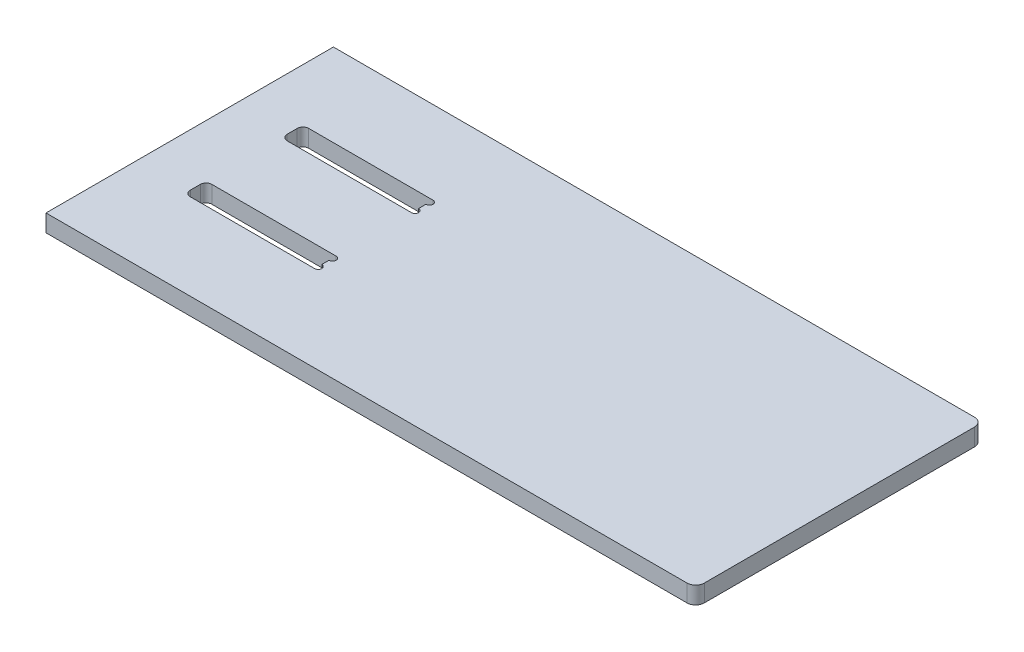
ISO-10303-21;
HEADER;
FILE_DESCRIPTION(('STEP AP214'),'2;1');
FILE_NAME('part.step','',(''),(''),'','','');
FILE_SCHEMA(('AUTOMOTIVE_DESIGN { 1 0 10303 214 1 1 1 1 }'));
ENDSEC;
DATA;
#1=APPLICATION_CONTEXT('core data for automotive mechanical design processes');
#2=APPLICATION_PROTOCOL_DEFINITION('international standard','automotive_design',2000,#1);
#3=PRODUCT_CONTEXT('',#1,'mechanical');
#4=PRODUCT('Part','Part','',(#3));
#5=PRODUCT_RELATED_PRODUCT_CATEGORY('part','',(#4));
#6=PRODUCT_DEFINITION_FORMATION('','',#4);
#7=PRODUCT_DEFINITION_CONTEXT('part definition',#1,'design');
#8=PRODUCT_DEFINITION('design','',#6,#7);
#9=PRODUCT_DEFINITION_SHAPE('','',#8);
#10=(LENGTH_UNIT() NAMED_UNIT(*) SI_UNIT(.MILLI.,.METRE.));
#11=(NAMED_UNIT(*) PLANE_ANGLE_UNIT() SI_UNIT($,.RADIAN.));
#12=(NAMED_UNIT(*) SI_UNIT($,.STERADIAN.) SOLID_ANGLE_UNIT());
#13=UNCERTAINTY_MEASURE_WITH_UNIT(LENGTH_MEASURE(1.E-05),#10,'distance_accuracy_value','');
#14=(GEOMETRIC_REPRESENTATION_CONTEXT(3) GLOBAL_UNCERTAINTY_ASSIGNED_CONTEXT((#13)) GLOBAL_UNIT_ASSIGNED_CONTEXT((#10,
#11,#12)) REPRESENTATION_CONTEXT('',''));
#15=CARTESIAN_POINT('',(0.,0.,0.));
#16=DIRECTION('',(0.,0.,1.));
#17=DIRECTION('',(1.,0.,0.));
#18=AXIS2_PLACEMENT_3D('',#15,#16,#17);
#19=CARTESIAN_POINT('',(220.05,12.,94.));
#20=DIRECTION('',(0.,-1.,0.));
#21=DIRECTION('',(0.,0.,-1.));
#22=AXIS2_PLACEMENT_3D('',#19,#20,#21);
#23=PLANE('',#22);
#24=CARTESIAN_POINT('',(-185.57,12.,36.0733333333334));
#25=DIRECTION('',(0.,1.,0.));
#26=DIRECTION('',(0.,0.,1.));
#27=AXIS2_PLACEMENT_3D('',#24,#25,#26);
#28=CIRCLE('',#27,4.);
#29=CARTESIAN_POINT('',(-189.57,12.,36.0733333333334));
#30=VERTEX_POINT('',#29);
#31=CARTESIAN_POINT('',(-185.57,12.,40.0733333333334));
#32=VERTEX_POINT('',#31);
#33=EDGE_CURVE('E249',#30,#32,#28,.T.);
#34=ORIENTED_EDGE('',*,*,#33,.F.);
#35=DIRECTION('',(0.,0.,1.));
#36=VECTOR('',#35,1.);
#37=CARTESIAN_POINT('',(-189.57,12.,29.0733333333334));
#38=LINE('',#37,#36);
#39=CARTESIAN_POINT('',(-189.57,12.,29.0733333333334));
#40=VERTEX_POINT('',#39);
#41=EDGE_CURVE('E265',#40,#30,#38,.T.);
#42=ORIENTED_EDGE('',*,*,#41,.F.);
#43=CARTESIAN_POINT('',(-185.57,12.,29.0733333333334));
#44=DIRECTION('',(0.,1.,0.));
#45=DIRECTION('',(0.,0.,1.));
#46=AXIS2_PLACEMENT_3D('',#43,#44,#45);
#47=CIRCLE('',#46,4.);
#48=CARTESIAN_POINT('',(-185.57,12.,25.0733333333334));
#49=VERTEX_POINT('',#48);
#50=EDGE_CURVE('E262',#49,#40,#47,.T.);
#51=ORIENTED_EDGE('',*,*,#50,.F.);
#52=DIRECTION('',(-1.,0.,0.));
#53=VECTOR('',#52,1.);
#54=CARTESIAN_POINT('',(-185.57,12.,25.0733333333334));
#55=LINE('',#54,#53);
#56=CARTESIAN_POINT('',(-99.07,12.,25.0733333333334));
#57=VERTEX_POINT('',#56);
#58=EDGE_CURVE('E260',#57,#49,#55,.T.);
#59=ORIENTED_EDGE('',*,*,#58,.F.);
#60=CARTESIAN_POINT('',(-99.07,12.,27.5733333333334));
#61=DIRECTION('',(0.,1.,0.));
#62=DIRECTION('',(0.,0.,1.));
#63=AXIS2_PLACEMENT_3D('',#60,#61,#62);
#64=CIRCLE('',#63,2.5);
#65=CARTESIAN_POINT('',(-99.07,12.,30.0733333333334));
#66=VERTEX_POINT('',#65);
#67=EDGE_CURVE('E258',#66,#57,#64,.T.);
#68=ORIENTED_EDGE('',*,*,#67,.F.);
#69=DIRECTION('',(0.,0.,-1.));
#70=VECTOR('',#69,1.);
#71=CARTESIAN_POINT('',(-99.07,12.,35.0733333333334));
#72=LINE('',#71,#70);
#73=CARTESIAN_POINT('',(-99.07,12.,35.0733333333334));
#74=VERTEX_POINT('',#73);
#75=EDGE_CURVE('E256',#74,#66,#72,.T.);
#76=ORIENTED_EDGE('',*,*,#75,.F.);
#77=CARTESIAN_POINT('',(-99.07,12.,37.5733333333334));
#78=DIRECTION('',(0.,1.,0.));
#79=DIRECTION('',(0.,0.,1.));
#80=AXIS2_PLACEMENT_3D('',#77,#78,#79);
#81=CIRCLE('',#80,2.5);
#82=CARTESIAN_POINT('',(-99.07,12.,40.0733333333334));
#83=VERTEX_POINT('',#82);
#84=EDGE_CURVE('E254',#83,#74,#81,.T.);
#85=ORIENTED_EDGE('',*,*,#84,.F.);
#86=DIRECTION('',(1.,0.,0.));
#87=VECTOR('',#86,1.);
#88=CARTESIAN_POINT('',(-185.57,12.,40.0733333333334));
#89=LINE('',#88,#87);
#90=EDGE_CURVE('E251',#32,#83,#89,.T.);
#91=ORIENTED_EDGE('',*,*,#90,.F.);
#92=EDGE_LOOP('',(#34,#42,#51,#59,#68,#76,#85,#91));
#93=FACE_BOUND('',#92,.T.);
#94=DIRECTION('',(0.,0.,1.));
#95=VECTOR('',#94,1.);
#96=CARTESIAN_POINT('',(-226.05,12.,-100.));
#97=LINE('',#96,#95);
#98=CARTESIAN_POINT('',(-226.05,12.,-100.));
#99=VERTEX_POINT('',#98);
#100=CARTESIAN_POINT('',(-226.05,12.,100.));
#101=VERTEX_POINT('',#100);
#102=EDGE_CURVE('E308',#99,#101,#97,.T.);
#103=ORIENTED_EDGE('',*,*,#102,.T.);
#104=DIRECTION('',(1.,0.,0.));
#105=VECTOR('',#104,1.);
#106=CARTESIAN_POINT('',(220.05,12.,100.));
#107=LINE('',#106,#105);
#108=CARTESIAN_POINT('',(220.05,12.,100.));
#109=VERTEX_POINT('',#108);
#110=EDGE_CURVE('E311',#101,#109,#107,.T.);
#111=ORIENTED_EDGE('',*,*,#110,.T.);
#112=CARTESIAN_POINT('',(220.05,12.,94.));
#113=DIRECTION('',(0.,1.,0.));
#114=DIRECTION('',(0.,0.,-1.));
#115=AXIS2_PLACEMENT_3D('',#112,#113,#114);
#116=CIRCLE('',#115,6.);
#117=CARTESIAN_POINT('',(226.05,12.,94.));
#118=VERTEX_POINT('',#117);
#119=EDGE_CURVE('E314',#109,#118,#116,.T.);
#120=ORIENTED_EDGE('',*,*,#119,.T.);
#121=DIRECTION('',(0.,0.,-1.));
#122=VECTOR('',#121,1.);
#123=CARTESIAN_POINT('',(226.05,12.,-94.));
#124=LINE('',#123,#122);
#125=CARTESIAN_POINT('',(226.05,12.,-94.));
#126=VERTEX_POINT('',#125);
#127=EDGE_CURVE('E316',#118,#126,#124,.T.);
#128=ORIENTED_EDGE('',*,*,#127,.T.);
#129=CARTESIAN_POINT('',(220.05,12.,-94.));
#130=DIRECTION('',(0.,1.,0.));
#131=DIRECTION('',(0.,0.,-1.));
#132=AXIS2_PLACEMENT_3D('',#129,#130,#131);
#133=CIRCLE('',#132,6.00000000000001);
#134=CARTESIAN_POINT('',(220.05,12.,-100.));
#135=VERTEX_POINT('',#134);
#136=EDGE_CURVE('E318',#126,#135,#133,.T.);
#137=ORIENTED_EDGE('',*,*,#136,.T.);
#138=DIRECTION('',(-1.,0.,0.));
#139=VECTOR('',#138,1.);
#140=CARTESIAN_POINT('',(220.05,12.,-100.));
#141=LINE('',#140,#139);
#142=EDGE_CURVE('E320',#135,#99,#141,.T.);
#143=ORIENTED_EDGE('',*,*,#142,.T.);
#144=EDGE_LOOP('',(#103,#111,#120,#128,#137,#143));
#145=FACE_BOUND('',#144,.T.);
#146=CARTESIAN_POINT('',(-185.57,12.,-31.3566666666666));
#147=DIRECTION('',(0.,1.,0.));
#148=DIRECTION('',(0.,0.,1.));
#149=AXIS2_PLACEMENT_3D('',#146,#147,#148);
#150=CIRCLE('',#149,4.);
#151=CARTESIAN_POINT('',(-189.57,12.,-31.3566666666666));
#152=VERTEX_POINT('',#151);
#153=CARTESIAN_POINT('',(-185.57,12.,-27.3566666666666));
#154=VERTEX_POINT('',#153);
#155=EDGE_CURVE('E184',#152,#154,#150,.T.);
#156=ORIENTED_EDGE('',*,*,#155,.F.);
#157=DIRECTION('',(0.,0.,1.));
#158=VECTOR('',#157,1.);
#159=CARTESIAN_POINT('',(-189.57,12.,-38.3566666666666));
#160=LINE('',#159,#158);
#161=CARTESIAN_POINT('',(-189.57,12.,-38.3566666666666));
#162=VERTEX_POINT('',#161);
#163=EDGE_CURVE('E217',#162,#152,#160,.T.);
#164=ORIENTED_EDGE('',*,*,#163,.F.);
#165=CARTESIAN_POINT('',(-185.57,12.,-38.3566666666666));
#166=DIRECTION('',(0.,1.,0.));
#167=DIRECTION('',(0.,0.,1.));
#168=AXIS2_PLACEMENT_3D('',#165,#166,#167);
#169=CIRCLE('',#168,4.);
#170=CARTESIAN_POINT('',(-185.57,12.,-42.3566666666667));
#171=VERTEX_POINT('',#170);
#172=EDGE_CURVE('E215',#171,#162,#169,.T.);
#173=ORIENTED_EDGE('',*,*,#172,.F.);
#174=DIRECTION('',(-1.,0.,0.));
#175=VECTOR('',#174,1.);
#176=CARTESIAN_POINT('',(-185.57,12.,-42.3566666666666));
#177=LINE('',#176,#175);
#178=CARTESIAN_POINT('',(-99.0700000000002,12.,-42.3566666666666));
#179=VERTEX_POINT('',#178);
#180=EDGE_CURVE('E213',#179,#171,#177,.T.);
#181=ORIENTED_EDGE('',*,*,#180,.F.);
#182=CARTESIAN_POINT('',(-99.0700000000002,12.,-39.8566666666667));
#183=DIRECTION('',(0.,1.,0.));
#184=DIRECTION('',(0.,0.,1.));
#185=AXIS2_PLACEMENT_3D('',#182,#183,#184);
#186=CIRCLE('',#185,2.5);
#187=CARTESIAN_POINT('',(-99.0700000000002,12.,-37.3566666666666));
#188=VERTEX_POINT('',#187);
#189=EDGE_CURVE('E211',#188,#179,#186,.T.);
#190=ORIENTED_EDGE('',*,*,#189,.F.);
#191=DIRECTION('',(0.,0.,-1.));
#192=VECTOR('',#191,1.);
#193=CARTESIAN_POINT('',(-99.0700000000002,12.,-32.3566666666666));
#194=LINE('',#193,#192);
#195=CARTESIAN_POINT('',(-99.0700000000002,12.,-32.3566666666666));
#196=VERTEX_POINT('',#195);
#197=EDGE_CURVE('E207',#196,#188,#194,.T.);
#198=ORIENTED_EDGE('',*,*,#197,.F.);
#199=CARTESIAN_POINT('',(-99.0700000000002,12.,-29.8566666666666));
#200=DIRECTION('',(0.,1.,0.));
#201=DIRECTION('',(0.,0.,1.));
#202=AXIS2_PLACEMENT_3D('',#199,#200,#201);
#203=CIRCLE('',#202,2.5);
#204=CARTESIAN_POINT('',(-99.0700000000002,12.,-27.3566666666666));
#205=VERTEX_POINT('',#204);
#206=EDGE_CURVE('E205',#205,#196,#203,.T.);
#207=ORIENTED_EDGE('',*,*,#206,.F.);
#208=DIRECTION('',(1.,0.,0.));
#209=VECTOR('',#208,1.);
#210=CARTESIAN_POINT('',(-185.57,12.,-27.3566666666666));
#211=LINE('',#210,#209);
#212=EDGE_CURVE('E192',#154,#205,#211,.T.);
#213=ORIENTED_EDGE('',*,*,#212,.F.);
#214=EDGE_LOOP('',(#156,#164,#173,#181,#190,#198,#207,#213));
#215=FACE_BOUND('',#214,.T.);
#216=ADVANCED_FACE('F35',(#93,#145,#215),#23,.F.);
#217=CARTESIAN_POINT('',(220.05,0.,94.));
#218=DIRECTION('',(0.,-1.,0.));
#219=DIRECTION('',(0.,0.,-1.));
#220=AXIS2_PLACEMENT_3D('',#217,#218,#219);
#221=PLANE('',#220);
#222=DIRECTION('',(0.,0.,1.));
#223=VECTOR('',#222,1.);
#224=CARTESIAN_POINT('',(-226.05,0.,-100.));
#225=LINE('',#224,#223);
#226=CARTESIAN_POINT('',(-226.05,0.,-100.));
#227=VERTEX_POINT('',#226);
#228=CARTESIAN_POINT('',(-226.05,0.,100.));
#229=VERTEX_POINT('',#228);
#230=EDGE_CURVE('E307',#227,#229,#225,.T.);
#231=ORIENTED_EDGE('',*,*,#230,.F.);
#232=DIRECTION('',(-1.,0.,0.));
#233=VECTOR('',#232,1.);
#234=CARTESIAN_POINT('',(220.05,0.,-100.));
#235=LINE('',#234,#233);
#236=CARTESIAN_POINT('',(220.05,0.,-100.));
#237=VERTEX_POINT('',#236);
#238=EDGE_CURVE('E312',#237,#227,#235,.T.);
#239=ORIENTED_EDGE('',*,*,#238,.F.);
#240=CARTESIAN_POINT('',(220.05,0.,-94.));
#241=DIRECTION('',(0.,1.,0.));
#242=DIRECTION('',(0.,0.,-1.));
#243=AXIS2_PLACEMENT_3D('',#240,#241,#242);
#244=CIRCLE('',#243,6.00000000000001);
#245=CARTESIAN_POINT('',(226.05,0.,-94.));
#246=VERTEX_POINT('',#245);
#247=EDGE_CURVE('E331',#246,#237,#244,.T.);
#248=ORIENTED_EDGE('',*,*,#247,.F.);
#249=DIRECTION('',(0.,0.,-1.));
#250=VECTOR('',#249,1.);
#251=CARTESIAN_POINT('',(226.05,0.,-94.));
#252=LINE('',#251,#250);
#253=CARTESIAN_POINT('',(226.05,0.,94.));
#254=VERTEX_POINT('',#253);
#255=EDGE_CURVE('E329',#254,#246,#252,.T.);
#256=ORIENTED_EDGE('',*,*,#255,.F.);
#257=CARTESIAN_POINT('',(220.05,0.,94.));
#258=DIRECTION('',(0.,1.,0.));
#259=DIRECTION('',(0.,0.,-1.));
#260=AXIS2_PLACEMENT_3D('',#257,#258,#259);
#261=CIRCLE('',#260,6.);
#262=CARTESIAN_POINT('',(220.05,0.,100.));
#263=VERTEX_POINT('',#262);
#264=EDGE_CURVE('E327',#263,#254,#261,.T.);
#265=ORIENTED_EDGE('',*,*,#264,.F.);
#266=DIRECTION('',(1.,0.,0.));
#267=VECTOR('',#266,1.);
#268=CARTESIAN_POINT('',(220.05,0.,100.));
#269=LINE('',#268,#267);
#270=EDGE_CURVE('E325',#229,#263,#269,.T.);
#271=ORIENTED_EDGE('',*,*,#270,.F.);
#272=EDGE_LOOP('',(#231,#239,#248,#256,#265,#271));
#273=FACE_BOUND('',#272,.T.);
#274=DIRECTION('',(0.,0.,1.));
#275=VECTOR('',#274,1.);
#276=CARTESIAN_POINT('',(-189.57,0.,29.0733333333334));
#277=LINE('',#276,#275);
#278=CARTESIAN_POINT('',(-189.57,0.,29.0733333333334));
#279=VERTEX_POINT('',#278);
#280=CARTESIAN_POINT('',(-189.57,0.,36.0733333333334));
#281=VERTEX_POINT('',#280);
#282=EDGE_CURVE('E252',#279,#281,#277,.T.);
#283=ORIENTED_EDGE('',*,*,#282,.T.);
#284=CARTESIAN_POINT('',(-185.57,0.,36.0733333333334));
#285=DIRECTION('',(0.,1.,0.));
#286=DIRECTION('',(0.,0.,1.));
#287=AXIS2_PLACEMENT_3D('',#284,#285,#286);
#288=CIRCLE('',#287,4.);
#289=CARTESIAN_POINT('',(-185.57,0.,40.0733333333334));
#290=VERTEX_POINT('',#289);
#291=EDGE_CURVE('E200',#281,#290,#288,.T.);
#292=ORIENTED_EDGE('',*,*,#291,.T.);
#293=DIRECTION('',(1.,0.,0.));
#294=VECTOR('',#293,1.);
#295=CARTESIAN_POINT('',(-185.57,0.,40.0733333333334));
#296=LINE('',#295,#294);
#297=CARTESIAN_POINT('',(-99.07,0.,40.0733333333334));
#298=VERTEX_POINT('',#297);
#299=EDGE_CURVE('E270',#290,#298,#296,.T.);
#300=ORIENTED_EDGE('',*,*,#299,.T.);
#301=CARTESIAN_POINT('',(-99.07,0.,37.5733333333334));
#302=DIRECTION('',(0.,1.,0.));
#303=DIRECTION('',(0.,0.,1.));
#304=AXIS2_PLACEMENT_3D('',#301,#302,#303);
#305=CIRCLE('',#304,2.5);
#306=CARTESIAN_POINT('',(-99.07,0.,35.0733333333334));
#307=VERTEX_POINT('',#306);
#308=EDGE_CURVE('E273',#298,#307,#305,.T.);
#309=ORIENTED_EDGE('',*,*,#308,.T.);
#310=DIRECTION('',(0.,0.,-1.));
#311=VECTOR('',#310,1.);
#312=CARTESIAN_POINT('',(-99.07,0.,35.0733333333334));
#313=LINE('',#312,#311);
#314=CARTESIAN_POINT('',(-99.07,0.,30.0733333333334));
#315=VERTEX_POINT('',#314);
#316=EDGE_CURVE('E276',#307,#315,#313,.T.);
#317=ORIENTED_EDGE('',*,*,#316,.T.);
#318=CARTESIAN_POINT('',(-99.07,0.,27.5733333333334));
#319=DIRECTION('',(0.,1.,0.));
#320=DIRECTION('',(0.,0.,1.));
#321=AXIS2_PLACEMENT_3D('',#318,#319,#320);
#322=CIRCLE('',#321,2.5);
#323=CARTESIAN_POINT('',(-99.07,0.,25.0733333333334));
#324=VERTEX_POINT('',#323);
#325=EDGE_CURVE('E279',#315,#324,#322,.T.);
#326=ORIENTED_EDGE('',*,*,#325,.T.);
#327=DIRECTION('',(-1.,0.,0.));
#328=VECTOR('',#327,1.);
#329=CARTESIAN_POINT('',(-185.57,0.,25.0733333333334));
#330=LINE('',#329,#328);
#331=CARTESIAN_POINT('',(-185.57,0.,25.0733333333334));
#332=VERTEX_POINT('',#331);
#333=EDGE_CURVE('E282',#324,#332,#330,.T.);
#334=ORIENTED_EDGE('',*,*,#333,.T.);
#335=CARTESIAN_POINT('',(-185.57,0.,29.0733333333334));
#336=DIRECTION('',(0.,1.,0.));
#337=DIRECTION('',(0.,0.,1.));
#338=AXIS2_PLACEMENT_3D('',#335,#336,#337);
#339=CIRCLE('',#338,4.);
#340=EDGE_CURVE('E285',#332,#279,#339,.T.);
#341=ORIENTED_EDGE('',*,*,#340,.T.);
#342=EDGE_LOOP('',(#283,#292,#300,#309,#317,#326,#334,#341));
#343=FACE_BOUND('',#342,.T.);
#344=DIRECTION('',(0.,0.,1.));
#345=VECTOR('',#344,1.);
#346=CARTESIAN_POINT('',(-189.57,0.,-38.3566666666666));
#347=LINE('',#346,#345);
#348=CARTESIAN_POINT('',(-189.57,0.,-38.3566666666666));
#349=VERTEX_POINT('',#348);
#350=CARTESIAN_POINT('',(-189.57,0.,-31.3566666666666));
#351=VERTEX_POINT('',#350);
#352=EDGE_CURVE('E193',#349,#351,#347,.T.);
#353=ORIENTED_EDGE('',*,*,#352,.T.);
#354=CARTESIAN_POINT('',(-185.57,0.,-31.3566666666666));
#355=DIRECTION('',(0.,1.,0.));
#356=DIRECTION('',(0.,0.,1.));
#357=AXIS2_PLACEMENT_3D('',#354,#355,#356);
#358=CIRCLE('',#357,4.);
#359=CARTESIAN_POINT('',(-185.57,0.,-27.3566666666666));
#360=VERTEX_POINT('',#359);
#361=EDGE_CURVE('E58',#351,#360,#358,.T.);
#362=ORIENTED_EDGE('',*,*,#361,.T.);
#363=DIRECTION('',(1.,0.,0.));
#364=VECTOR('',#363,1.);
#365=CARTESIAN_POINT('',(-185.57,0.,-27.3566666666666));
#366=LINE('',#365,#364);
#367=CARTESIAN_POINT('',(-99.0700000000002,0.,-27.3566666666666));
#368=VERTEX_POINT('',#367);
#369=EDGE_CURVE('E199',#360,#368,#366,.T.);
#370=ORIENTED_EDGE('',*,*,#369,.T.);
#371=CARTESIAN_POINT('',(-99.0700000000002,0.,-29.8566666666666));
#372=DIRECTION('',(0.,1.,0.));
#373=DIRECTION('',(0.,0.,1.));
#374=AXIS2_PLACEMENT_3D('',#371,#372,#373);
#375=CIRCLE('',#374,2.5);
#376=CARTESIAN_POINT('',(-99.0700000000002,0.,-32.3566666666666));
#377=VERTEX_POINT('',#376);
#378=EDGE_CURVE('E221',#368,#377,#375,.T.);
#379=ORIENTED_EDGE('',*,*,#378,.T.);
#380=DIRECTION('',(0.,0.,-1.));
#381=VECTOR('',#380,1.);
#382=CARTESIAN_POINT('',(-99.0700000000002,0.,-32.3566666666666));
#383=LINE('',#382,#381);
#384=CARTESIAN_POINT('',(-99.0700000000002,0.,-37.3566666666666));
#385=VERTEX_POINT('',#384);
#386=EDGE_CURVE('E224',#377,#385,#383,.T.);
#387=ORIENTED_EDGE('',*,*,#386,.T.);
#388=CARTESIAN_POINT('',(-99.0700000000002,0.,-39.8566666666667));
#389=DIRECTION('',(0.,1.,0.));
#390=DIRECTION('',(0.,0.,1.));
#391=AXIS2_PLACEMENT_3D('',#388,#389,#390);
#392=CIRCLE('',#391,2.5);
#393=CARTESIAN_POINT('',(-99.0700000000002,0.,-42.3566666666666));
#394=VERTEX_POINT('',#393);
#395=EDGE_CURVE('E227',#385,#394,#392,.T.);
#396=ORIENTED_EDGE('',*,*,#395,.T.);
#397=DIRECTION('',(-1.,0.,0.));
#398=VECTOR('',#397,1.);
#399=CARTESIAN_POINT('',(-185.57,0.,-42.3566666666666));
#400=LINE('',#399,#398);
#401=CARTESIAN_POINT('',(-185.57,0.,-42.3566666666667));
#402=VERTEX_POINT('',#401);
#403=EDGE_CURVE('E230',#394,#402,#400,.T.);
#404=ORIENTED_EDGE('',*,*,#403,.T.);
#405=CARTESIAN_POINT('',(-185.57,0.,-38.3566666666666));
#406=DIRECTION('',(0.,1.,0.));
#407=DIRECTION('',(0.,0.,1.));
#408=AXIS2_PLACEMENT_3D('',#405,#406,#407);
#409=CIRCLE('',#408,4.);
#410=EDGE_CURVE('E233',#402,#349,#409,.T.);
#411=ORIENTED_EDGE('',*,*,#410,.T.);
#412=EDGE_LOOP('',(#353,#362,#370,#379,#387,#396,#404,#411));
#413=FACE_BOUND('',#412,.T.);
#414=ADVANCED_FACE('F355',(#273,#343,#413),#221,.T.);
#415=CARTESIAN_POINT('',(-226.05,12.,-100.));
#416=DIRECTION('',(1.,0.,0.));
#417=DIRECTION('',(0.,0.,-1.));
#418=AXIS2_PLACEMENT_3D('',#415,#416,#417);
#419=PLANE('',#418);
#420=ORIENTED_EDGE('',*,*,#230,.T.);
#421=DIRECTION('',(0.,-1.,0.));
#422=VECTOR('',#421,1.);
#423=CARTESIAN_POINT('',(-226.05,12.,100.));
#424=LINE('',#423,#422);
#425=EDGE_CURVE('E11',#101,#229,#424,.T.);
#426=ORIENTED_EDGE('',*,*,#425,.F.);
#427=ORIENTED_EDGE('',*,*,#102,.F.);
#428=DIRECTION('',(0.,-1.,0.));
#429=VECTOR('',#428,1.);
#430=CARTESIAN_POINT('',(-226.05,12.,-100.));
#431=LINE('',#430,#429);
#432=EDGE_CURVE('E322',#99,#227,#431,.T.);
#433=ORIENTED_EDGE('',*,*,#432,.T.);
#434=EDGE_LOOP('',(#420,#426,#427,#433));
#435=FACE_BOUND('',#434,.T.);
#436=ADVANCED_FACE('F37',(#435),#419,.F.);
#437=CARTESIAN_POINT('',(220.05,12.,100.));
#438=DIRECTION('',(0.,0.,-1.));
#439=DIRECTION('',(-1.,0.,0.));
#440=AXIS2_PLACEMENT_3D('',#437,#438,#439);
#441=PLANE('',#440);
#442=ORIENTED_EDGE('',*,*,#270,.T.);
#443=DIRECTION('',(0.,-1.,0.));
#444=VECTOR('',#443,1.);
#445=CARTESIAN_POINT('',(220.05,12.,100.));
#446=LINE('',#445,#444);
#447=EDGE_CURVE('E43',#109,#263,#446,.T.);
#448=ORIENTED_EDGE('',*,*,#447,.F.);
#449=ORIENTED_EDGE('',*,*,#110,.F.);
#450=ORIENTED_EDGE('',*,*,#425,.T.);
#451=EDGE_LOOP('',(#442,#448,#449,#450));
#452=FACE_BOUND('',#451,.T.);
#453=ADVANCED_FACE('F372',(#452),#441,.F.);
#454=CARTESIAN_POINT('',(220.05,12.,94.));
#455=DIRECTION('',(0.,-1.,0.));
#456=DIRECTION('',(0.,0.,-1.));
#457=AXIS2_PLACEMENT_3D('',#454,#455,#456);
#458=CYLINDRICAL_SURFACE('',#457,6.);
#459=ORIENTED_EDGE('',*,*,#264,.T.);
#460=DIRECTION('',(0.,-1.,0.));
#461=VECTOR('',#460,1.);
#462=CARTESIAN_POINT('',(226.05,12.,94.));
#463=LINE('',#462,#461);
#464=EDGE_CURVE('E342',#118,#254,#463,.T.);
#465=ORIENTED_EDGE('',*,*,#464,.F.);
#466=ORIENTED_EDGE('',*,*,#119,.F.);
#467=ORIENTED_EDGE('',*,*,#447,.T.);
#468=EDGE_LOOP('',(#459,#465,#466,#467));
#469=FACE_BOUND('',#468,.T.);
#470=ADVANCED_FACE('F349',(#469),#458,.T.);
#471=CARTESIAN_POINT('',(226.05,12.,-94.));
#472=DIRECTION('',(-1.,0.,0.));
#473=DIRECTION('',(0.,0.,1.));
#474=AXIS2_PLACEMENT_3D('',#471,#472,#473);
#475=PLANE('',#474);
#476=ORIENTED_EDGE('',*,*,#255,.T.);
#477=DIRECTION('',(0.,-1.,0.));
#478=VECTOR('',#477,1.);
#479=CARTESIAN_POINT('',(226.05,12.,-94.));
#480=LINE('',#479,#478);
#481=EDGE_CURVE('E339',#126,#246,#480,.T.);
#482=ORIENTED_EDGE('',*,*,#481,.F.);
#483=ORIENTED_EDGE('',*,*,#127,.F.);
#484=ORIENTED_EDGE('',*,*,#464,.T.);
#485=EDGE_LOOP('',(#476,#482,#483,#484));
#486=FACE_BOUND('',#485,.T.);
#487=ADVANCED_FACE('F361',(#486),#475,.F.);
#488=CARTESIAN_POINT('',(220.05,12.,-94.));
#489=DIRECTION('',(0.,-1.,0.));
#490=DIRECTION('',(0.,0.,-1.));
#491=AXIS2_PLACEMENT_3D('',#488,#489,#490);
#492=CYLINDRICAL_SURFACE('',#491,6.00000000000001);
#493=ORIENTED_EDGE('',*,*,#247,.T.);
#494=DIRECTION('',(0.,-1.,0.));
#495=VECTOR('',#494,1.);
#496=CARTESIAN_POINT('',(220.05,12.,-100.));
#497=LINE('',#496,#495);
#498=EDGE_CURVE('E336',#135,#237,#497,.T.);
#499=ORIENTED_EDGE('',*,*,#498,.F.);
#500=ORIENTED_EDGE('',*,*,#136,.F.);
#501=ORIENTED_EDGE('',*,*,#481,.T.);
#502=EDGE_LOOP('',(#493,#499,#500,#501));
#503=FACE_BOUND('',#502,.T.);
#504=ADVANCED_FACE('F365',(#503),#492,.T.);
#505=CARTESIAN_POINT('',(220.05,12.,-100.));
#506=DIRECTION('',(0.,0.,1.));
#507=DIRECTION('',(1.,0.,0.));
#508=AXIS2_PLACEMENT_3D('',#505,#506,#507);
#509=PLANE('',#508);
#510=ORIENTED_EDGE('',*,*,#238,.T.);
#511=ORIENTED_EDGE('',*,*,#432,.F.);
#512=ORIENTED_EDGE('',*,*,#142,.F.);
#513=ORIENTED_EDGE('',*,*,#498,.T.);
#514=EDGE_LOOP('',(#510,#511,#512,#513));
#515=FACE_BOUND('',#514,.T.);
#516=ADVANCED_FACE('F375',(#515),#509,.F.);
#517=CARTESIAN_POINT('',(-185.57,12.,36.0733333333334));
#518=DIRECTION('',(0.,-1.,0.));
#519=DIRECTION('',(0.,0.,-1.));
#520=AXIS2_PLACEMENT_3D('',#517,#518,#519);
#521=CYLINDRICAL_SURFACE('',#520,4.);
#522=ORIENTED_EDGE('',*,*,#291,.F.);
#523=DIRECTION('',(0.,-1.,0.));
#524=VECTOR('',#523,1.);
#525=CARTESIAN_POINT('',(-189.57,12.,36.0733333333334));
#526=LINE('',#525,#524);
#527=EDGE_CURVE('E267',#30,#281,#526,.T.);
#528=ORIENTED_EDGE('',*,*,#527,.F.);
#529=ORIENTED_EDGE('',*,*,#33,.T.);
#530=DIRECTION('',(0.,-1.,0.));
#531=VECTOR('',#530,1.);
#532=CARTESIAN_POINT('',(-185.57,12.,40.0733333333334));
#533=LINE('',#532,#531);
#534=EDGE_CURVE('E304',#32,#290,#533,.T.);
#535=ORIENTED_EDGE('',*,*,#534,.T.);
#536=EDGE_LOOP('',(#522,#528,#529,#535));
#537=FACE_BOUND('',#536,.T.);
#538=ADVANCED_FACE('F377',(#537),#521,.F.);
#539=CARTESIAN_POINT('',(-185.57,12.,40.0733333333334));
#540=DIRECTION('',(0.,0.,-1.));
#541=DIRECTION('',(-1.,0.,0.));
#542=AXIS2_PLACEMENT_3D('',#539,#540,#541);
#543=PLANE('',#542);
#544=ORIENTED_EDGE('',*,*,#299,.F.);
#545=ORIENTED_EDGE('',*,*,#534,.F.);
#546=ORIENTED_EDGE('',*,*,#90,.T.);
#547=DIRECTION('',(0.,-1.,0.));
#548=VECTOR('',#547,1.);
#549=CARTESIAN_POINT('',(-99.07,12.,40.0733333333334));
#550=LINE('',#549,#548);
#551=EDGE_CURVE('E302',#83,#298,#550,.T.);
#552=ORIENTED_EDGE('',*,*,#551,.T.);
#553=EDGE_LOOP('',(#544,#545,#546,#552));
#554=FACE_BOUND('',#553,.T.);
#555=ADVANCED_FACE('F383',(#554),#543,.T.);
#556=CARTESIAN_POINT('',(-99.07,12.,37.5733333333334));
#557=DIRECTION('',(0.,-1.,0.));
#558=DIRECTION('',(0.,0.,-1.));
#559=AXIS2_PLACEMENT_3D('',#556,#557,#558);
#560=CYLINDRICAL_SURFACE('',#559,2.5);
#561=ORIENTED_EDGE('',*,*,#308,.F.);
#562=ORIENTED_EDGE('',*,*,#551,.F.);
#563=ORIENTED_EDGE('',*,*,#84,.T.);
#564=DIRECTION('',(0.,-1.,0.));
#565=VECTOR('',#564,1.);
#566=CARTESIAN_POINT('',(-99.07,12.,35.0733333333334));
#567=LINE('',#566,#565);
#568=EDGE_CURVE('E300',#74,#307,#567,.T.);
#569=ORIENTED_EDGE('',*,*,#568,.T.);
#570=EDGE_LOOP('',(#561,#562,#563,#569));
#571=FACE_BOUND('',#570,.T.);
#572=ADVANCED_FACE('F398',(#571),#560,.F.);
#573=CARTESIAN_POINT('',(-99.07,12.,35.0733333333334));
#574=DIRECTION('',(-1.,0.,0.));
#575=DIRECTION('',(0.,0.,1.));
#576=AXIS2_PLACEMENT_3D('',#573,#574,#575);
#577=PLANE('',#576);
#578=ORIENTED_EDGE('',*,*,#316,.F.);
#579=ORIENTED_EDGE('',*,*,#568,.F.);
#580=ORIENTED_EDGE('',*,*,#75,.T.);
#581=DIRECTION('',(0.,-1.,0.));
#582=VECTOR('',#581,1.);
#583=CARTESIAN_POINT('',(-99.07,12.,30.0733333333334));
#584=LINE('',#583,#582);
#585=EDGE_CURVE('E298',#66,#315,#584,.T.);
#586=ORIENTED_EDGE('',*,*,#585,.T.);
#587=EDGE_LOOP('',(#578,#579,#580,#586));
#588=FACE_BOUND('',#587,.T.);
#589=ADVANCED_FACE('F402',(#588),#577,.T.);
#590=CARTESIAN_POINT('',(-99.07,12.,27.5733333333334));
#591=DIRECTION('',(0.,-1.,0.));
#592=DIRECTION('',(0.,0.,-1.));
#593=AXIS2_PLACEMENT_3D('',#590,#591,#592);
#594=CYLINDRICAL_SURFACE('',#593,2.5);
#595=ORIENTED_EDGE('',*,*,#325,.F.);
#596=ORIENTED_EDGE('',*,*,#585,.F.);
#597=ORIENTED_EDGE('',*,*,#67,.T.);
#598=DIRECTION('',(0.,-1.,0.));
#599=VECTOR('',#598,1.);
#600=CARTESIAN_POINT('',(-99.07,12.,25.0733333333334));
#601=LINE('',#600,#599);
#602=EDGE_CURVE('E296',#57,#324,#601,.T.);
#603=ORIENTED_EDGE('',*,*,#602,.T.);
#604=EDGE_LOOP('',(#595,#596,#597,#603));
#605=FACE_BOUND('',#604,.T.);
#606=ADVANCED_FACE('F406',(#605),#594,.F.);
#607=CARTESIAN_POINT('',(-185.57,12.,25.0733333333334));
#608=DIRECTION('',(0.,0.,1.));
#609=DIRECTION('',(1.,0.,0.));
#610=AXIS2_PLACEMENT_3D('',#607,#608,#609);
#611=PLANE('',#610);
#612=ORIENTED_EDGE('',*,*,#333,.F.);
#613=ORIENTED_EDGE('',*,*,#602,.F.);
#614=ORIENTED_EDGE('',*,*,#58,.T.);
#615=DIRECTION('',(0.,-1.,0.));
#616=VECTOR('',#615,1.);
#617=CARTESIAN_POINT('',(-185.57,12.,25.0733333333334));
#618=LINE('',#617,#616);
#619=EDGE_CURVE('E294',#49,#332,#618,.T.);
#620=ORIENTED_EDGE('',*,*,#619,.T.);
#621=EDGE_LOOP('',(#612,#613,#614,#620));
#622=FACE_BOUND('',#621,.T.);
#623=ADVANCED_FACE('F410',(#622),#611,.T.);
#624=CARTESIAN_POINT('',(-185.57,12.,29.0733333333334));
#625=DIRECTION('',(0.,-1.,0.));
#626=DIRECTION('',(0.,0.,-1.));
#627=AXIS2_PLACEMENT_3D('',#624,#625,#626);
#628=CYLINDRICAL_SURFACE('',#627,4.);
#629=ORIENTED_EDGE('',*,*,#340,.F.);
#630=ORIENTED_EDGE('',*,*,#619,.F.);
#631=ORIENTED_EDGE('',*,*,#50,.T.);
#632=DIRECTION('',(0.,-1.,0.));
#633=VECTOR('',#632,1.);
#634=CARTESIAN_POINT('',(-189.57,12.,29.0733333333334));
#635=LINE('',#634,#633);
#636=EDGE_CURVE('E292',#40,#279,#635,.T.);
#637=ORIENTED_EDGE('',*,*,#636,.T.);
#638=EDGE_LOOP('',(#629,#630,#631,#637));
#639=FACE_BOUND('',#638,.T.);
#640=ADVANCED_FACE('F414',(#639),#628,.F.);
#641=CARTESIAN_POINT('',(-189.57,12.,29.0733333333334));
#642=DIRECTION('',(1.,0.,0.));
#643=DIRECTION('',(0.,0.,-1.));
#644=AXIS2_PLACEMENT_3D('',#641,#642,#643);
#645=PLANE('',#644);
#646=ORIENTED_EDGE('',*,*,#282,.F.);
#647=ORIENTED_EDGE('',*,*,#636,.F.);
#648=ORIENTED_EDGE('',*,*,#41,.T.);
#649=ORIENTED_EDGE('',*,*,#527,.T.);
#650=EDGE_LOOP('',(#646,#647,#648,#649));
#651=FACE_BOUND('',#650,.T.);
#652=ADVANCED_FACE('F418',(#651),#645,.T.);
#653=CARTESIAN_POINT('',(-185.57,12.,-31.3566666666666));
#654=DIRECTION('',(0.,-1.,0.));
#655=DIRECTION('',(0.,0.,-1.));
#656=AXIS2_PLACEMENT_3D('',#653,#654,#655);
#657=CYLINDRICAL_SURFACE('',#656,4.);
#658=ORIENTED_EDGE('',*,*,#361,.F.);
#659=DIRECTION('',(0.,-1.,0.));
#660=VECTOR('',#659,1.);
#661=CARTESIAN_POINT('',(-189.57,12.,-31.3566666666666));
#662=LINE('',#661,#660);
#663=EDGE_CURVE('E188',#152,#351,#662,.T.);
#664=ORIENTED_EDGE('',*,*,#663,.F.);
#665=ORIENTED_EDGE('',*,*,#155,.T.);
#666=DIRECTION('',(0.,-1.,0.));
#667=VECTOR('',#666,1.);
#668=CARTESIAN_POINT('',(-185.57,12.,-27.3566666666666));
#669=LINE('',#668,#667);
#670=EDGE_CURVE('E187',#154,#360,#669,.T.);
#671=ORIENTED_EDGE('',*,*,#670,.T.);
#672=EDGE_LOOP('',(#658,#664,#665,#671));
#673=FACE_BOUND('',#672,.T.);
#674=ADVANCED_FACE('F186',(#673),#657,.F.);
#675=CARTESIAN_POINT('',(-185.57,12.,-27.3566666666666));
#676=DIRECTION('',(0.,0.,-1.));
#677=DIRECTION('',(-1.,0.,0.));
#678=AXIS2_PLACEMENT_3D('',#675,#676,#677);
#679=PLANE('',#678);
#680=ORIENTED_EDGE('',*,*,#369,.F.);
#681=ORIENTED_EDGE('',*,*,#670,.F.);
#682=ORIENTED_EDGE('',*,*,#212,.T.);
#683=DIRECTION('',(0.,-1.,0.));
#684=VECTOR('',#683,1.);
#685=CARTESIAN_POINT('',(-99.0700000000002,12.,-27.3566666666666));
#686=LINE('',#685,#684);
#687=EDGE_CURVE('E201',#205,#368,#686,.T.);
#688=ORIENTED_EDGE('',*,*,#687,.T.);
#689=EDGE_LOOP('',(#680,#681,#682,#688));
#690=FACE_BOUND('',#689,.T.);
#691=ADVANCED_FACE('F196',(#690),#679,.T.);
#692=CARTESIAN_POINT('',(-99.0700000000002,12.,-29.8566666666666));
#693=DIRECTION('',(0.,-1.,0.));
#694=DIRECTION('',(0.,0.,-1.));
#695=AXIS2_PLACEMENT_3D('',#692,#693,#694);
#696=CYLINDRICAL_SURFACE('',#695,2.5);
#697=ORIENTED_EDGE('',*,*,#378,.F.);
#698=ORIENTED_EDGE('',*,*,#687,.F.);
#699=ORIENTED_EDGE('',*,*,#206,.T.);
#700=DIRECTION('',(0.,-1.,0.));
#701=VECTOR('',#700,1.);
#702=CARTESIAN_POINT('',(-99.0700000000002,12.,-32.3566666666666));
#703=LINE('',#702,#701);
#704=EDGE_CURVE('E246',#196,#377,#703,.T.);
#705=ORIENTED_EDGE('',*,*,#704,.T.);
#706=EDGE_LOOP('',(#697,#698,#699,#705));
#707=FACE_BOUND('',#706,.T.);
#708=ADVANCED_FACE('F427',(#707),#696,.F.);
#709=CARTESIAN_POINT('',(-99.0700000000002,12.,-32.3566666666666));
#710=DIRECTION('',(-1.,0.,0.));
#711=DIRECTION('',(0.,0.,1.));
#712=AXIS2_PLACEMENT_3D('',#709,#710,#711);
#713=PLANE('',#712);
#714=ORIENTED_EDGE('',*,*,#386,.F.);
#715=ORIENTED_EDGE('',*,*,#704,.F.);
#716=ORIENTED_EDGE('',*,*,#197,.T.);
#717=DIRECTION('',(0.,-1.,0.));
#718=VECTOR('',#717,1.);
#719=CARTESIAN_POINT('',(-99.0700000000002,12.,-37.3566666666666));
#720=LINE('',#719,#718);
#721=EDGE_CURVE('E244',#188,#385,#720,.T.);
#722=ORIENTED_EDGE('',*,*,#721,.T.);
#723=EDGE_LOOP('',(#714,#715,#716,#722));
#724=FACE_BOUND('',#723,.T.);
#725=ADVANCED_FACE('F430',(#724),#713,.T.);
#726=CARTESIAN_POINT('',(-99.0700000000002,12.,-39.8566666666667));
#727=DIRECTION('',(0.,-1.,0.));
#728=DIRECTION('',(0.,0.,-1.));
#729=AXIS2_PLACEMENT_3D('',#726,#727,#728);
#730=CYLINDRICAL_SURFACE('',#729,2.5);
#731=ORIENTED_EDGE('',*,*,#395,.F.);
#732=ORIENTED_EDGE('',*,*,#721,.F.);
#733=ORIENTED_EDGE('',*,*,#189,.T.);
#734=DIRECTION('',(0.,-1.,0.));
#735=VECTOR('',#734,1.);
#736=CARTESIAN_POINT('',(-99.0700000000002,12.,-42.3566666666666));
#737=LINE('',#736,#735);
#738=EDGE_CURVE('E242',#179,#394,#737,.T.);
#739=ORIENTED_EDGE('',*,*,#738,.T.);
#740=EDGE_LOOP('',(#731,#732,#733,#739));
#741=FACE_BOUND('',#740,.T.);
#742=ADVANCED_FACE('F434',(#741),#730,.F.);
#743=CARTESIAN_POINT('',(-185.57,12.,-42.3566666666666));
#744=DIRECTION('',(0.,0.,1.));
#745=DIRECTION('',(1.,0.,0.));
#746=AXIS2_PLACEMENT_3D('',#743,#744,#745);
#747=PLANE('',#746);
#748=ORIENTED_EDGE('',*,*,#403,.F.);
#749=ORIENTED_EDGE('',*,*,#738,.F.);
#750=ORIENTED_EDGE('',*,*,#180,.T.);
#751=DIRECTION('',(0.,-1.,0.));
#752=VECTOR('',#751,1.);
#753=CARTESIAN_POINT('',(-185.57,12.,-42.3566666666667));
#754=LINE('',#753,#752);
#755=EDGE_CURVE('E240',#171,#402,#754,.T.);
#756=ORIENTED_EDGE('',*,*,#755,.T.);
#757=EDGE_LOOP('',(#748,#749,#750,#756));
#758=FACE_BOUND('',#757,.T.);
#759=ADVANCED_FACE('F438',(#758),#747,.T.);
#760=CARTESIAN_POINT('',(-185.57,12.,-38.3566666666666));
#761=DIRECTION('',(0.,-1.,0.));
#762=DIRECTION('',(0.,0.,-1.));
#763=AXIS2_PLACEMENT_3D('',#760,#761,#762);
#764=CYLINDRICAL_SURFACE('',#763,4.);
#765=ORIENTED_EDGE('',*,*,#410,.F.);
#766=ORIENTED_EDGE('',*,*,#755,.F.);
#767=ORIENTED_EDGE('',*,*,#172,.T.);
#768=DIRECTION('',(0.,-1.,0.));
#769=VECTOR('',#768,1.);
#770=CARTESIAN_POINT('',(-189.57,12.,-38.3566666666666));
#771=LINE('',#770,#769);
#772=EDGE_CURVE('E50',#162,#349,#771,.T.);
#773=ORIENTED_EDGE('',*,*,#772,.T.);
#774=EDGE_LOOP('',(#765,#766,#767,#773));
#775=FACE_BOUND('',#774,.T.);
#776=ADVANCED_FACE('F442',(#775),#764,.F.);
#777=CARTESIAN_POINT('',(-189.57,12.,-38.3566666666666));
#778=DIRECTION('',(1.,0.,0.));
#779=DIRECTION('',(0.,0.,-1.));
#780=AXIS2_PLACEMENT_3D('',#777,#778,#779);
#781=PLANE('',#780);
#782=ORIENTED_EDGE('',*,*,#352,.F.);
#783=ORIENTED_EDGE('',*,*,#772,.F.);
#784=ORIENTED_EDGE('',*,*,#163,.T.);
#785=ORIENTED_EDGE('',*,*,#663,.T.);
#786=EDGE_LOOP('',(#782,#783,#784,#785));
#787=FACE_BOUND('',#786,.T.);
#788=ADVANCED_FACE('F446',(#787),#781,.T.);
#789=CLOSED_SHELL('',(#216,#414,#436,#453,#470,#487,#504,#516,#538,#555,#572,#589,#606,#623,
#640,#652,#674,#691,#708,#725,#742,#759,#776,#788));
#790=MANIFOLD_SOLID_BREP('B2',#789);
#791=ADVANCED_BREP_SHAPE_REPRESENTATION('',(#18,#790),#14);
#792=SHAPE_DEFINITION_REPRESENTATION(#9,#791);
ENDSEC;
END-ISO-10303-21;
